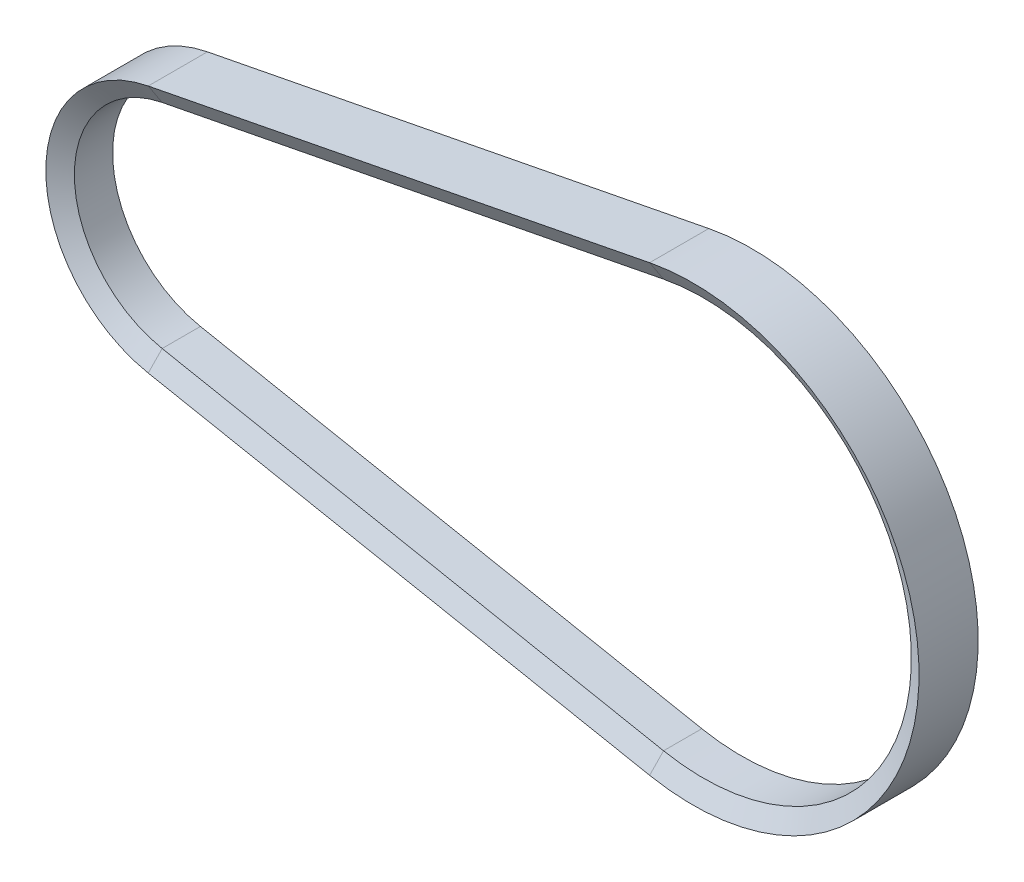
ISO-10303-21;
HEADER;
FILE_DESCRIPTION(('STEP AP214'),'2;1');
FILE_NAME('part.step','',(''),(''),'','','');
FILE_SCHEMA(('AUTOMOTIVE_DESIGN { 1 0 10303 214 1 1 1 1 }'));
ENDSEC;
DATA;
#1=APPLICATION_CONTEXT('core data for automotive mechanical design processes');
#2=APPLICATION_PROTOCOL_DEFINITION('international standard','automotive_design',2000,#1);
#3=PRODUCT_CONTEXT('',#1,'mechanical');
#4=PRODUCT('Part','Part','',(#3));
#5=PRODUCT_RELATED_PRODUCT_CATEGORY('part','',(#4));
#6=PRODUCT_DEFINITION_FORMATION('','',#4);
#7=PRODUCT_DEFINITION_CONTEXT('part definition',#1,'design');
#8=PRODUCT_DEFINITION('design','',#6,#7);
#9=PRODUCT_DEFINITION_SHAPE('','',#8);
#10=(LENGTH_UNIT() NAMED_UNIT(*) SI_UNIT(.MILLI.,.METRE.));
#11=(NAMED_UNIT(*) PLANE_ANGLE_UNIT() SI_UNIT($,.RADIAN.));
#12=(NAMED_UNIT(*) SI_UNIT($,.STERADIAN.) SOLID_ANGLE_UNIT());
#13=UNCERTAINTY_MEASURE_WITH_UNIT(LENGTH_MEASURE(1.E-05),#10,'distance_accuracy_value','');
#14=(GEOMETRIC_REPRESENTATION_CONTEXT(3) GLOBAL_UNCERTAINTY_ASSIGNED_CONTEXT((#13)) GLOBAL_UNIT_ASSIGNED_CONTEXT((#10,
#11,#12)) REPRESENTATION_CONTEXT('',''));
#15=CARTESIAN_POINT('',(0.,0.,0.));
#16=DIRECTION('',(0.,0.,1.));
#17=DIRECTION('',(1.,0.,0.));
#18=AXIS2_PLACEMENT_3D('',#15,#16,#17);
#19=CARTESIAN_POINT('',(26.3749426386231,12.2693775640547,1.635));
#20=DIRECTION('',(-0.0956022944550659,0.490775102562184,-0.866025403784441));
#21=DIRECTION('',(0.,0.870010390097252,0.493033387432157));
#22=AXIS2_PLACEMENT_3D('',#19,#20,#21);
#23=PLANE('',#22);
#24=DIRECTION('',(0.165588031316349,-0.850047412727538,-0.499999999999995));
#25=VECTOR('',#24,1.);
#26=CARTESIAN_POINT('',(26.3749426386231,12.2693775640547,1.635));
#27=LINE('',#26,#25);
#28=CARTESIAN_POINT('',(26.3749426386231,12.2693775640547,1.635));
#29=VERTEX_POINT('',#28);
#30=CARTESIAN_POINT('',(26.5661472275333,11.2878273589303,1.05764973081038));
#31=VERTEX_POINT('',#30);
#32=EDGE_CURVE('E161',#29,#31,#27,.T.);
#33=ORIENTED_EDGE('',*,*,#32,.F.);
#34=DIRECTION('',(-0.981550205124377,-0.191204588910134,0.));
#35=VECTOR('',#34,1.);
#36=CARTESIAN_POINT('',(26.3749426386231,12.2693775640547,1.635));
#37=LINE('',#36,#35);
#38=CARTESIAN_POINT('',(-1.33843212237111,6.8708514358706,1.635));
#39=VERTEX_POINT('',#38);
#40=EDGE_CURVE('E39',#29,#39,#37,.T.);
#41=ORIENTED_EDGE('',*,*,#40,.T.);
#42=DIRECTION('',(0.165588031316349,-0.850047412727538,-0.499999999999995));
#43=VECTOR('',#42,1.);
#44=CARTESIAN_POINT('',(-1.33843212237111,6.8708514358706,1.635));
#45=LINE('',#44,#43);
#46=CARTESIAN_POINT('',(-1.14722753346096,5.88930123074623,1.05764973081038));
#47=VERTEX_POINT('',#46);
#48=EDGE_CURVE('E182',#39,#47,#45,.T.);
#49=ORIENTED_EDGE('',*,*,#48,.T.);
#50=DIRECTION('',(-0.981550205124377,-0.191204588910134,0.));
#51=VECTOR('',#50,1.);
#52=CARTESIAN_POINT('',(26.5661472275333,11.2878273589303,1.05764973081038));
#53=LINE('',#52,#51);
#54=EDGE_CURVE('E11',#31,#47,#53,.T.);
#55=ORIENTED_EDGE('',*,*,#54,.F.);
#56=EDGE_LOOP('',(#33,#41,#49,#55));
#57=FACE_BOUND('',#56,.T.);
#58=ADVANCED_FACE('F31',(#57),#23,.F.);
#59=CARTESIAN_POINT('',(26.3749426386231,12.2693775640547,1.635));
#60=DIRECTION('',(0.191204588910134,-0.981550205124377,0.));
#61=DIRECTION('',(0.981550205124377,0.191204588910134,0.));
#62=AXIS2_PLACEMENT_3D('',#59,#60,#61);
#63=PLANE('',#62);
#64=DIRECTION('',(0.,0.,1.));
#65=VECTOR('',#64,1.);
#66=CARTESIAN_POINT('',(26.3749426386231,12.2693775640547,1.635));
#67=LINE('',#66,#65);
#68=CARTESIAN_POINT('',(26.3749426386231,12.2693775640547,-1.635));
#69=VERTEX_POINT('',#68);
#70=EDGE_CURVE('E158',#69,#29,#67,.T.);
#71=ORIENTED_EDGE('',*,*,#70,.F.);
#72=DIRECTION('',(-0.981550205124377,-0.191204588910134,0.));
#73=VECTOR('',#72,1.);
#74=CARTESIAN_POINT('',(26.3749426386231,12.2693775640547,-1.635));
#75=LINE('',#74,#73);
#76=CARTESIAN_POINT('',(-1.33843212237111,6.8708514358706,-1.635));
#77=VERTEX_POINT('',#76);
#78=EDGE_CURVE('E188',#69,#77,#75,.T.);
#79=ORIENTED_EDGE('',*,*,#78,.T.);
#80=DIRECTION('',(0.,0.,1.));
#81=VECTOR('',#80,1.);
#82=CARTESIAN_POINT('',(-1.33843212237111,6.8708514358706,1.635));
#83=LINE('',#82,#81);
#84=EDGE_CURVE('E179',#77,#39,#83,.T.);
#85=ORIENTED_EDGE('',*,*,#84,.T.);
#86=ORIENTED_EDGE('',*,*,#40,.F.);
#87=EDGE_LOOP('',(#71,#79,#85,#86));
#88=FACE_BOUND('',#87,.T.);
#89=ADVANCED_FACE('F207',(#88),#63,.F.);
#90=CARTESIAN_POINT('',(26.3749426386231,12.2693775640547,-1.635));
#91=DIRECTION('',(-0.0956022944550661,0.490775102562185,0.866025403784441));
#92=DIRECTION('',(0.,-0.870010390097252,0.493033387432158));
#93=AXIS2_PLACEMENT_3D('',#90,#91,#92);
#94=PLANE('',#93);
#95=DIRECTION('',(-0.165588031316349,0.850047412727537,-0.499999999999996));
#96=VECTOR('',#95,1.);
#97=CARTESIAN_POINT('',(26.3749426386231,12.2693775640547,-1.635));
#98=LINE('',#97,#96);
#99=CARTESIAN_POINT('',(26.5661472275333,11.2878273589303,-1.05764973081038));
#100=VERTEX_POINT('',#99);
#101=EDGE_CURVE('E155',#100,#69,#98,.T.);
#102=ORIENTED_EDGE('',*,*,#101,.F.);
#103=DIRECTION('',(-0.981550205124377,-0.191204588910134,0.));
#104=VECTOR('',#103,1.);
#105=CARTESIAN_POINT('',(26.5661472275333,11.2878273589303,-1.05764973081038));
#106=LINE('',#105,#104);
#107=CARTESIAN_POINT('',(-1.14722753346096,5.88930123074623,-1.05764973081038));
#108=VERTEX_POINT('',#107);
#109=EDGE_CURVE('E185',#100,#108,#106,.T.);
#110=ORIENTED_EDGE('',*,*,#109,.T.);
#111=DIRECTION('',(-0.165588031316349,0.850047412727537,-0.499999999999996));
#112=VECTOR('',#111,1.);
#113=CARTESIAN_POINT('',(-1.33843212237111,6.8708514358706,-1.635));
#114=LINE('',#113,#112);
#115=EDGE_CURVE('E127',#108,#77,#114,.T.);
#116=ORIENTED_EDGE('',*,*,#115,.T.);
#117=ORIENTED_EDGE('',*,*,#78,.F.);
#118=EDGE_LOOP('',(#102,#110,#116,#117));
#119=FACE_BOUND('',#118,.T.);
#120=ADVANCED_FACE('F205',(#119),#94,.F.);
#121=CARTESIAN_POINT('',(26.5661472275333,11.2878273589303,-1.05764973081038));
#122=DIRECTION('',(-0.191204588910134,0.981550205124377,0.));
#123=DIRECTION('',(-0.981550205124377,-0.191204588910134,0.));
#124=AXIS2_PLACEMENT_3D('',#121,#122,#123);
#125=PLANE('',#124);
#126=DIRECTION('',(0.,0.,-1.));
#127=VECTOR('',#126,1.);
#128=CARTESIAN_POINT('',(26.5661472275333,11.2878273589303,-1.05764973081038));
#129=LINE('',#128,#127);
#130=EDGE_CURVE('E152',#31,#100,#129,.T.);
#131=ORIENTED_EDGE('',*,*,#130,.F.);
#132=ORIENTED_EDGE('',*,*,#54,.T.);
#133=DIRECTION('',(0.,0.,-1.));
#134=VECTOR('',#133,1.);
#135=CARTESIAN_POINT('',(-1.14722753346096,5.88930123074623,-1.05764973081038));
#136=LINE('',#135,#134);
#137=EDGE_CURVE('E176',#47,#108,#136,.T.);
#138=ORIENTED_EDGE('',*,*,#137,.T.);
#139=ORIENTED_EDGE('',*,*,#109,.F.);
#140=EDGE_LOOP('',(#131,#132,#138,#139));
#141=FACE_BOUND('',#140,.T.);
#142=ADVANCED_FACE('F225',(#141),#125,.F.);
#143=CARTESIAN_POINT('',(28.765,0.,1.635));
#144=DIRECTION('',(0.,0.,1.));
#145=DIRECTION('',(1.,0.,0.));
#146=AXIS2_PLACEMENT_3D('',#143,#144,#145);
#147=CONICAL_SURFACE('',#146,12.5,1.0471975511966);
#148=DIRECTION('',(0.165588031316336,0.85004741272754,-0.499999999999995));
#149=VECTOR('',#148,1.);
#150=CARTESIAN_POINT('',(26.3749426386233,-12.2693775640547,1.635));
#151=LINE('',#150,#149);
#152=CARTESIAN_POINT('',(26.3749426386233,-12.2693775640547,1.635));
#153=VERTEX_POINT('',#152);
#154=CARTESIAN_POINT('',(26.5661472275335,-11.2878273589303,1.05764973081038));
#155=VERTEX_POINT('',#154);
#156=EDGE_CURVE('E112',#153,#155,#151,.T.);
#157=ORIENTED_EDGE('',*,*,#156,.F.);
#158=CARTESIAN_POINT('',(28.765,0.,1.635));
#159=DIRECTION('',(0.,0.,1.));
#160=DIRECTION('',(1.,0.,0.));
#161=AXIS2_PLACEMENT_3D('',#158,#159,#160);
#162=CIRCLE('',#161,12.5);
#163=EDGE_CURVE('E170',#153,#29,#162,.T.);
#164=ORIENTED_EDGE('',*,*,#163,.T.);
#165=ORIENTED_EDGE('',*,*,#32,.T.);
#166=CARTESIAN_POINT('',(28.765,0.,1.05764973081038));
#167=DIRECTION('',(0.,0.,1.));
#168=DIRECTION('',(1.,0.,0.));
#169=AXIS2_PLACEMENT_3D('',#166,#167,#168);
#170=CIRCLE('',#169,11.5);
#171=EDGE_CURVE('E173',#155,#31,#170,.T.);
#172=ORIENTED_EDGE('',*,*,#171,.F.);
#173=EDGE_LOOP('',(#157,#164,#165,#172));
#174=FACE_BOUND('',#173,.T.);
#175=ADVANCED_FACE('F228',(#174),#147,.F.);
#176=CARTESIAN_POINT('',(28.765,0.,0.));
#177=DIRECTION('',(0.,0.,1.));
#178=DIRECTION('',(1.,0.,0.));
#179=AXIS2_PLACEMENT_3D('',#176,#177,#178);
#180=CYLINDRICAL_SURFACE('',#179,12.5);
#181=DIRECTION('',(0.,0.,1.));
#182=VECTOR('',#181,1.);
#183=CARTESIAN_POINT('',(26.3749426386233,-12.2693775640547,1.635));
#184=LINE('',#183,#182);
#185=CARTESIAN_POINT('',(26.3749426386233,-12.2693775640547,-1.635));
#186=VERTEX_POINT('',#185);
#187=EDGE_CURVE('E141',#186,#153,#184,.T.);
#188=ORIENTED_EDGE('',*,*,#187,.F.);
#189=CARTESIAN_POINT('',(28.765,0.,-1.635));
#190=DIRECTION('',(0.,0.,1.));
#191=DIRECTION('',(1.,0.,0.));
#192=AXIS2_PLACEMENT_3D('',#189,#190,#191);
#193=CIRCLE('',#192,12.5);
#194=EDGE_CURVE('E167',#186,#69,#193,.T.);
#195=ORIENTED_EDGE('',*,*,#194,.T.);
#196=ORIENTED_EDGE('',*,*,#70,.T.);
#197=ORIENTED_EDGE('',*,*,#163,.F.);
#198=EDGE_LOOP('',(#188,#195,#196,#197));
#199=FACE_BOUND('',#198,.T.);
#200=ADVANCED_FACE('F214',(#199),#180,.T.);
#201=CARTESIAN_POINT('',(28.765,0.,-1.05764973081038));
#202=DIRECTION('',(0.,0.,-1.));
#203=DIRECTION('',(-1.,0.,0.));
#204=AXIS2_PLACEMENT_3D('',#201,#202,#203);
#205=CONICAL_SURFACE('',#204,11.5,1.0471975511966);
#206=DIRECTION('',(-0.165588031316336,-0.85004741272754,-0.499999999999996));
#207=VECTOR('',#206,1.);
#208=CARTESIAN_POINT('',(26.3749426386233,-12.2693775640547,-1.635));
#209=LINE('',#208,#207);
#210=CARTESIAN_POINT('',(26.5661472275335,-11.2878273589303,-1.05764973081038));
#211=VERTEX_POINT('',#210);
#212=EDGE_CURVE('E139',#211,#186,#209,.T.);
#213=ORIENTED_EDGE('',*,*,#212,.F.);
#214=CARTESIAN_POINT('',(28.765,0.,-1.05764973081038));
#215=DIRECTION('',(0.,0.,1.));
#216=DIRECTION('',(1.,0.,0.));
#217=AXIS2_PLACEMENT_3D('',#214,#215,#216);
#218=CIRCLE('',#217,11.5);
#219=EDGE_CURVE('E164',#211,#100,#218,.T.);
#220=ORIENTED_EDGE('',*,*,#219,.T.);
#221=ORIENTED_EDGE('',*,*,#101,.T.);
#222=ORIENTED_EDGE('',*,*,#194,.F.);
#223=EDGE_LOOP('',(#213,#220,#221,#222));
#224=FACE_BOUND('',#223,.T.);
#225=ADVANCED_FACE('F212',(#224),#205,.F.);
#226=CARTESIAN_POINT('',(28.765,0.,0.));
#227=DIRECTION('',(0.,0.,1.));
#228=DIRECTION('',(1.,0.,0.));
#229=AXIS2_PLACEMENT_3D('',#226,#227,#228);
#230=CYLINDRICAL_SURFACE('',#229,11.5);
#231=DIRECTION('',(0.,0.,-1.));
#232=VECTOR('',#231,1.);
#233=CARTESIAN_POINT('',(26.5661472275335,-11.2878273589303,-1.05764973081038));
#234=LINE('',#233,#232);
#235=EDGE_CURVE('E108',#155,#211,#234,.T.);
#236=ORIENTED_EDGE('',*,*,#235,.F.);
#237=ORIENTED_EDGE('',*,*,#171,.T.);
#238=ORIENTED_EDGE('',*,*,#130,.T.);
#239=ORIENTED_EDGE('',*,*,#219,.F.);
#240=EDGE_LOOP('',(#236,#237,#238,#239));
#241=FACE_BOUND('',#240,.T.);
#242=ADVANCED_FACE('F229',(#241),#230,.F.);
#243=CARTESIAN_POINT('',(-1.33843212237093,-6.87085143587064,1.635));
#244=DIRECTION('',(-0.0956022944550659,-0.490775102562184,-0.866025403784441));
#245=DIRECTION('',(0.,0.870010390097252,-0.493033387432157));
#246=AXIS2_PLACEMENT_3D('',#243,#244,#245);
#247=PLANE('',#246);
#248=DIRECTION('',(0.165588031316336,0.85004741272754,-0.499999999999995));
#249=VECTOR('',#248,1.);
#250=CARTESIAN_POINT('',(-1.33843212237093,-6.87085143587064,1.635));
#251=LINE('',#250,#249);
#252=CARTESIAN_POINT('',(-1.33843212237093,-6.87085143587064,1.635));
#253=VERTEX_POINT('',#252);
#254=CARTESIAN_POINT('',(-1.1472275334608,-5.88930123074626,1.05764973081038));
#255=VERTEX_POINT('',#254);
#256=EDGE_CURVE('E136',#253,#255,#251,.T.);
#257=ORIENTED_EDGE('',*,*,#256,.F.);
#258=DIRECTION('',(0.981550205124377,-0.191204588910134,0.));
#259=VECTOR('',#258,1.);
#260=CARTESIAN_POINT('',(-1.33843212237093,-6.87085143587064,1.635));
#261=LINE('',#260,#259);
#262=EDGE_CURVE('E147',#253,#153,#261,.T.);
#263=ORIENTED_EDGE('',*,*,#262,.T.);
#264=ORIENTED_EDGE('',*,*,#156,.T.);
#265=DIRECTION('',(0.981550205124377,-0.191204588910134,0.));
#266=VECTOR('',#265,1.);
#267=CARTESIAN_POINT('',(-1.1472275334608,-5.88930123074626,1.05764973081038));
#268=LINE('',#267,#266);
#269=EDGE_CURVE('E150',#255,#155,#268,.T.);
#270=ORIENTED_EDGE('',*,*,#269,.F.);
#271=EDGE_LOOP('',(#257,#263,#264,#270));
#272=FACE_BOUND('',#271,.T.);
#273=ADVANCED_FACE('F220',(#272),#247,.F.);
#274=CARTESIAN_POINT('',(-1.33843212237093,-6.87085143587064,1.635));
#275=DIRECTION('',(0.191204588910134,0.981550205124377,0.));
#276=DIRECTION('',(-0.981550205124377,0.191204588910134,0.));
#277=AXIS2_PLACEMENT_3D('',#274,#275,#276);
#278=PLANE('',#277);
#279=DIRECTION('',(0.,0.,1.));
#280=VECTOR('',#279,1.);
#281=CARTESIAN_POINT('',(-1.33843212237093,-6.87085143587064,1.635));
#282=LINE('',#281,#280);
#283=CARTESIAN_POINT('',(-1.33843212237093,-6.87085143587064,-1.635));
#284=VERTEX_POINT('',#283);
#285=EDGE_CURVE('E121',#284,#253,#282,.T.);
#286=ORIENTED_EDGE('',*,*,#285,.F.);
#287=DIRECTION('',(0.981550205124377,-0.191204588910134,0.));
#288=VECTOR('',#287,1.);
#289=CARTESIAN_POINT('',(-1.33843212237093,-6.87085143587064,-1.635));
#290=LINE('',#289,#288);
#291=EDGE_CURVE('E111',#284,#186,#290,.T.);
#292=ORIENTED_EDGE('',*,*,#291,.T.);
#293=ORIENTED_EDGE('',*,*,#187,.T.);
#294=ORIENTED_EDGE('',*,*,#262,.F.);
#295=EDGE_LOOP('',(#286,#292,#293,#294));
#296=FACE_BOUND('',#295,.T.);
#297=ADVANCED_FACE('F217',(#296),#278,.F.);
#298=CARTESIAN_POINT('',(-1.33843212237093,-6.87085143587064,-1.635));
#299=DIRECTION('',(-0.0956022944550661,-0.490775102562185,0.866025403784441));
#300=DIRECTION('',(0.,-0.870010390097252,-0.493033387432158));
#301=AXIS2_PLACEMENT_3D('',#298,#299,#300);
#302=PLANE('',#301);
#303=DIRECTION('',(-0.165588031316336,-0.85004741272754,-0.499999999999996));
#304=VECTOR('',#303,1.);
#305=CARTESIAN_POINT('',(-1.33843212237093,-6.87085143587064,-1.635));
#306=LINE('',#305,#304);
#307=CARTESIAN_POINT('',(-1.1472275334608,-5.88930123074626,-1.05764973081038));
#308=VERTEX_POINT('',#307);
#309=EDGE_CURVE('E115',#308,#284,#306,.T.);
#310=ORIENTED_EDGE('',*,*,#309,.F.);
#311=DIRECTION('',(0.981550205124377,-0.191204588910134,0.));
#312=VECTOR('',#311,1.);
#313=CARTESIAN_POINT('',(-1.1472275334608,-5.88930123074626,-1.05764973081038));
#314=LINE('',#313,#312);
#315=EDGE_CURVE('E101',#308,#211,#314,.T.);
#316=ORIENTED_EDGE('',*,*,#315,.T.);
#317=ORIENTED_EDGE('',*,*,#212,.T.);
#318=ORIENTED_EDGE('',*,*,#291,.F.);
#319=EDGE_LOOP('',(#310,#316,#317,#318));
#320=FACE_BOUND('',#319,.T.);
#321=ADVANCED_FACE('F117',(#320),#302,.F.);
#322=CARTESIAN_POINT('',(-1.1472275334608,-5.88930123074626,-1.05764973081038));
#323=DIRECTION('',(-0.191204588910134,-0.981550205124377,0.));
#324=DIRECTION('',(0.981550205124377,-0.191204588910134,0.));
#325=AXIS2_PLACEMENT_3D('',#322,#323,#324);
#326=PLANE('',#325);
#327=DIRECTION('',(0.,0.,-1.));
#328=VECTOR('',#327,1.);
#329=CARTESIAN_POINT('',(-1.1472275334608,-5.88930123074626,-1.05764973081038));
#330=LINE('',#329,#328);
#331=EDGE_CURVE('E106',#255,#308,#330,.T.);
#332=ORIENTED_EDGE('',*,*,#331,.F.);
#333=ORIENTED_EDGE('',*,*,#269,.T.);
#334=ORIENTED_EDGE('',*,*,#235,.T.);
#335=ORIENTED_EDGE('',*,*,#315,.F.);
#336=EDGE_LOOP('',(#332,#333,#334,#335));
#337=FACE_BOUND('',#336,.T.);
#338=ADVANCED_FACE('F103',(#337),#326,.F.);
#339=CARTESIAN_POINT('',(0.,0.,0.));
#340=DIRECTION('',(0.,0.,-1.));
#341=DIRECTION('',(-1.,0.,0.));
#342=AXIS2_PLACEMENT_3D('',#339,#340,#341);
#343=CYLINDRICAL_SURFACE('',#342,6.);
#344=CARTESIAN_POINT('',(0.,0.,-1.05764973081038));
#345=DIRECTION('',(0.,0.,-1.));
#346=DIRECTION('',(-1.,0.,0.));
#347=AXIS2_PLACEMENT_3D('',#344,#345,#346);
#348=CIRCLE('',#347,6.);
#349=EDGE_CURVE('E124',#308,#108,#348,.T.);
#350=ORIENTED_EDGE('',*,*,#349,.T.);
#351=ORIENTED_EDGE('',*,*,#137,.F.);
#352=CARTESIAN_POINT('',(0.,0.,1.05764973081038));
#353=DIRECTION('',(0.,0.,-1.));
#354=DIRECTION('',(-1.,0.,0.));
#355=AXIS2_PLACEMENT_3D('',#352,#353,#354);
#356=CIRCLE('',#355,6.);
#357=EDGE_CURVE('E47',#255,#47,#356,.T.);
#358=ORIENTED_EDGE('',*,*,#357,.F.);
#359=ORIENTED_EDGE('',*,*,#331,.T.);
#360=EDGE_LOOP('',(#350,#351,#358,#359));
#361=FACE_BOUND('',#360,.T.);
#362=ADVANCED_FACE('F132',(#361),#343,.F.);
#363=CARTESIAN_POINT('',(0.,0.,-1.05764973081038));
#364=DIRECTION('',(0.,0.,-1.));
#365=DIRECTION('',(-1.,0.,0.));
#366=AXIS2_PLACEMENT_3D('',#363,#364,#365);
#367=CONICAL_SURFACE('',#366,6.,1.0471975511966);
#368=CARTESIAN_POINT('',(0.,0.,-1.635));
#369=DIRECTION('',(0.,0.,-1.));
#370=DIRECTION('',(-1.,0.,0.));
#371=AXIS2_PLACEMENT_3D('',#368,#369,#370);
#372=CIRCLE('',#371,7.);
#373=EDGE_CURVE('E130',#284,#77,#372,.T.);
#374=ORIENTED_EDGE('',*,*,#373,.T.);
#375=ORIENTED_EDGE('',*,*,#115,.F.);
#376=ORIENTED_EDGE('',*,*,#349,.F.);
#377=ORIENTED_EDGE('',*,*,#309,.T.);
#378=EDGE_LOOP('',(#374,#375,#376,#377));
#379=FACE_BOUND('',#378,.T.);
#380=ADVANCED_FACE('F125',(#379),#367,.F.);
#381=CARTESIAN_POINT('',(0.,0.,0.));
#382=DIRECTION('',(0.,0.,-1.));
#383=DIRECTION('',(-1.,0.,0.));
#384=AXIS2_PLACEMENT_3D('',#381,#382,#383);
#385=CYLINDRICAL_SURFACE('',#384,7.);
#386=CARTESIAN_POINT('',(0.,0.,1.635));
#387=DIRECTION('',(0.,0.,-1.));
#388=DIRECTION('',(-1.,0.,0.));
#389=AXIS2_PLACEMENT_3D('',#386,#387,#388);
#390=CIRCLE('',#389,7.);
#391=EDGE_CURVE('E55',#253,#39,#390,.T.);
#392=ORIENTED_EDGE('',*,*,#391,.T.);
#393=ORIENTED_EDGE('',*,*,#84,.F.);
#394=ORIENTED_EDGE('',*,*,#373,.F.);
#395=ORIENTED_EDGE('',*,*,#285,.T.);
#396=EDGE_LOOP('',(#392,#393,#394,#395));
#397=FACE_BOUND('',#396,.T.);
#398=ADVANCED_FACE('F201',(#397),#385,.T.);
#399=CARTESIAN_POINT('',(0.,0.,1.635));
#400=DIRECTION('',(0.,0.,1.));
#401=DIRECTION('',(1.,0.,0.));
#402=AXIS2_PLACEMENT_3D('',#399,#400,#401);
#403=CONICAL_SURFACE('',#402,7.,1.0471975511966);
#404=ORIENTED_EDGE('',*,*,#256,.T.);
#405=ORIENTED_EDGE('',*,*,#357,.T.);
#406=ORIENTED_EDGE('',*,*,#48,.F.);
#407=ORIENTED_EDGE('',*,*,#391,.F.);
#408=EDGE_LOOP('',(#404,#405,#406,#407));
#409=FACE_BOUND('',#408,.T.);
#410=ADVANCED_FACE('F221',(#409),#403,.F.);
#411=CLOSED_SHELL('',(#58,#89,#120,#142,#175,#200,#225,#242,#273,#297,#321,#338,#362,#380,#398,#410));
#412=MANIFOLD_SOLID_BREP('B2',#411);
#413=ADVANCED_BREP_SHAPE_REPRESENTATION('',(#18,#412),#14);
#414=SHAPE_DEFINITION_REPRESENTATION(#9,#413);
ENDSEC;
END-ISO-10303-21;
